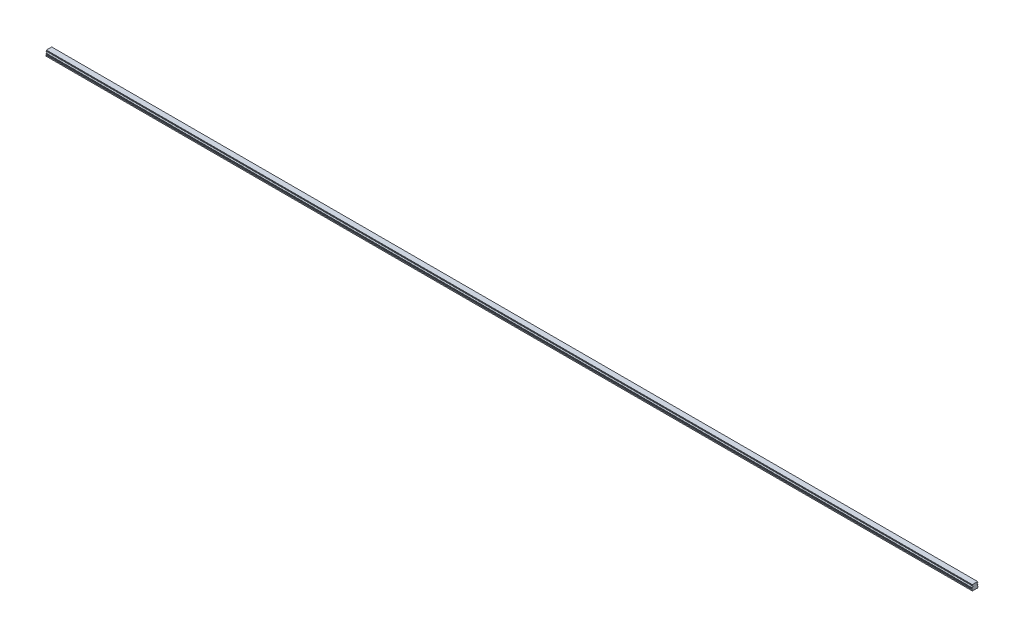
from build123d import *

# Parameters (mm, degrees)
BOSS_EXTRUDE1_DEPTH        = 2280
SKETCH3_R                  = 2.5
SKETCH3_R_2                = 2.1
CUT_EXTRUDE3_DEPTH         = 7
SKETCH3_2_R                = 2.1
CUT_EXTRUDE4_DEPTH         = 9.5
CHAMFER1_SIZE              = 0.4
LPATTERN2_COUNT            = 38
LPATTERN2_PITCH            = 60
CHAMFER1_OF_LPATTERN2_SIZE = 0.4


with BuildPart() as part:
    # Sketch1 → Boss-Extrude1 (new body)
    with BuildSketch(Plane(origin=(0, 0, 0), x_dir=(0, 0, -1), z_dir=(1, 0, 0))):
        with BuildLine():
            Line((6.59, 14), (-6.59, 14))
            Line((-6.59, 14), (-6.59, 13.15))
            Line((-6.59, 13.15), (-6.96, 12.356532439))
            Line((-6.96, 12.356532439), (-6.96, 11.435174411))
            ThreePointArc((-6.96, 11.435174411), (-5.25, 9.5), (-6.96, 7.564825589))
            Line((-6.96, 7.564825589), (-6.96, 6.643467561))
            Line((-6.96, 6.643467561), (-6.59, 5.85))
            Line((-6.59, 5.85), (-7.032116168, 4.2))
            Line((-7.032116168, 4.2), (-7.5, 3.929867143))
            Line((-7.5, 3.929867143), (-7.5, 1.4))
            Line((-7.5, 1.4), (-6.1, 0))
            Line((-6.1, 0), (-3.65, 0))
            Line((-3.65, 0), (-3.25, 0.4))
            Line((-3.25, 0.4), (3.25, 0.4))
            Line((3.25, 0.4), (3.65, 0))
            Line((3.65, 0), (6.1, 0))
            Line((6.1, 0), (7.5, 1.4))
            Line((7.5, 1.4), (7.5, 3.929867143))
            Line((7.5, 3.929867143), (7.032116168, 4.2))
            Line((7.032116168, 4.2), (6.59, 5.85))
            Line((6.59, 5.85), (6.96, 6.643467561))
            Line((6.96, 6.643467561), (6.96, 7.564825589))
            ThreePointArc((6.96, 7.564825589), (5.25, 9.5), (6.96, 11.435174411))
            Line((6.96, 11.435174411), (6.96, 12.356532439))
            Line((6.96, 12.356532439), (6.59, 13.15))
            Line((6.59, 13.15), (6.59, 14))
        make_face()
    extrude(amount=BOSS_EXTRUDE1_DEPTH)

    # Sketch3 → Cut-Extrude3 (cut)
    with BuildSketch(Plane.XZ):
        with Locations(Location((30, 0, 0), (0, 0, 270))):
            Circle(SKETCH3_R)
        with Locations(Location((30, 0, 0), (0, 0, 270))):
            Circle(SKETCH3_R_2, mode=Mode.SUBTRACT)
    cut_extrude3 = extrude(amount=-CUT_EXTRUDE3_DEPTH, mode=Mode.SUBTRACT)

    # Sketch3_2 → Cut-Extrude4 (cut)
    with BuildSketch(Plane.XZ):
        with Locations(Location((30, 0, 0), (0, 0, 270))):
            Circle(SKETCH3_2_R)
    cut_extrude4 = extrude(amount=-CUT_EXTRUDE4_DEPTH, mode=Mode.SUBTRACT)

    # Cut-Extrude5 cone 1 section (on through the dimple's axis) → Cut-Extrude5 (revolve, cut)
    with BuildSketch(Plane(origin=(30, 9.5, 0), x_dir=(0, 0, -1), z_dir=(1, 0, 0))):
        Polygon((0, 0), (2.1, 0), (0, 1.212435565), align=None)
    revolve(axis=Axis((30, 9.5, 0), (0, 1, 0)), mode=Mode.SUBTRACT)

    # Chamfer1
    chamfer1_edges = [part.edges().sort_by_distance(p)[0] for p in [
        (30, 0.4, 2.5),
    ]]
    chamfer(chamfer1_edges, length=CHAMFER1_SIZE)

    # LPattern2: Cut-Extrude3, Cut-Extrude4 ×38
    with Locations(*[(i * LPATTERN2_PITCH, 0, 0) for i in range(1, LPATTERN2_COUNT)]):
        add(cut_extrude3, mode=Mode.SUBTRACT)
        add(cut_extrude4, mode=Mode.SUBTRACT)

    # Chamfer1 of LPattern2
    chamfer1_of_lpattern2_edges = [part.edges().sort_by_distance(p)[0] for p in [
        (90, 0.4, 2.5),
        (150, 0.4, 2.5),
        (210, 0.4, 2.5),
        (270, 0.4, 2.5),
        (330, 0.4, 2.5),
        (390, 0.4, 2.5),
        (450, 0.4, 2.5),
        (510, 0.4, 2.5),
        (570, 0.4, 2.5),
        (630, 0.4, 2.5),
        (690, 0.4, 2.5),
        (750, 0.4, 2.5),
        (810, 0.4, 2.5),
        (870, 0.4, 2.5),
        (930, 0.4, 2.5),
        (990, 0.4, 2.5),
        (1050, 0.4, 2.5),
        (1110, 0.4, 2.5),
        (1170, 0.4, 2.5),
        (1230, 0.4, 2.5),
        (1290, 0.4, 2.5),
        (1350, 0.4, 2.5),
        (1410, 0.4, 2.5),
        (1470, 0.4, 2.5),
        (1530, 0.4, 2.5),
        (1590, 0.4, 2.5),
        (1650, 0.4, 2.5),
        (1710, 0.4, 2.5),
        (1770, 0.4, 2.5),
        (1830, 0.4, 2.5),
        (1890, 0.4, 2.5),
        (1950, 0.4, 2.5),
        (2010, 0.4, 2.5),
        (2070, 0.4, 2.5),
        (2130, 0.4, 2.5),
        (2190, 0.4, 2.5),
        (2250, 0.4, 2.5),
    ]]
    chamfer(chamfer1_of_lpattern2_edges, length=CHAMFER1_OF_LPATTERN2_SIZE)


solid = part.part
